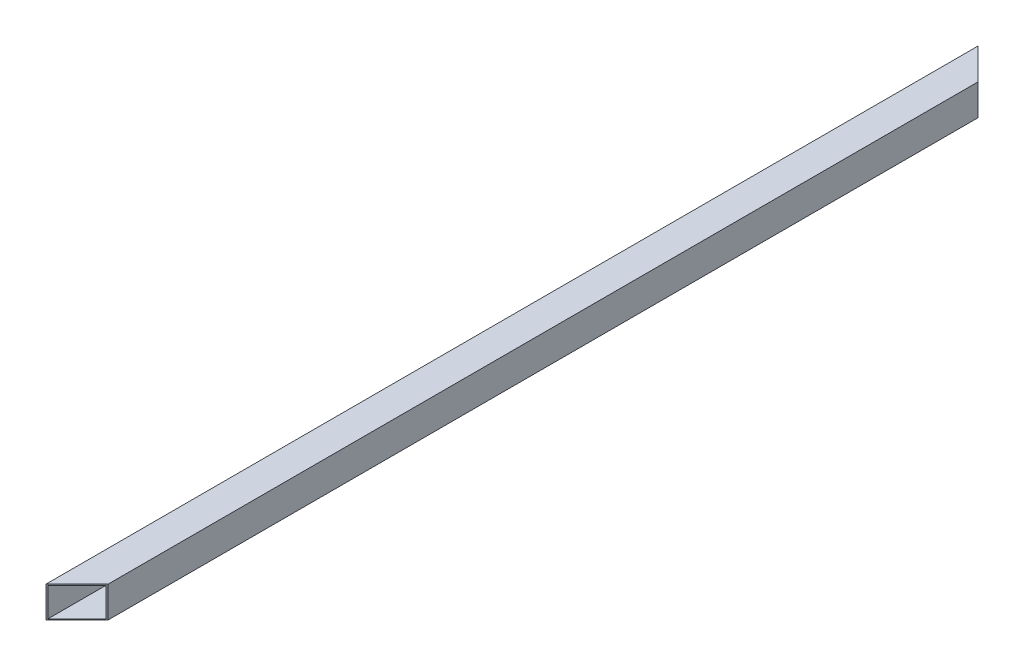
from build123d import *

# Parameters (mm, degrees)
SCHIZZO1_W                = 30
SCHIZZO1_H                = 30
SCHIZZO1_W_2              = 28
SCHIZZO1_H_2              = 28
ESTRUSIONE_SOTTILE1_DEPTH = 900
TAGLIO_ESTRUSIONE1_REACH  = 902.625


with BuildPart() as part:
    # Schizzo1 → Estrusione-Sottile1 (new body)
    with BuildSketch(Plane.XY):
        Rectangle(SCHIZZO1_W, SCHIZZO1_H)
        Rectangle(SCHIZZO1_W_2, SCHIZZO1_H_2, mode=Mode.SUBTRACT)
    extrude(amount=ESTRUSIONE_SOTTILE1_DEPTH)

    # Schizzo3 → Taglio-Estrusione1 (cut, up to next)
    with BuildSketch(Plane(origin=(0, 15, 0), x_dir=(1, 0, 0), z_dir=(0, 1, 0)), mode=Mode.PRIVATE) as taglio_estrusione1_sk1:
        Polygon((-15, 0), (15, -30), (15, 0), align=None)
    taglio_estrusione1_tool1 = extrude(taglio_estrusione1_sk1.sketch, amount=-TAGLIO_ESTRUSIONE1_REACH, mode=Mode.PRIVATE) & part.part
    taglio_estrusione1 = taglio_estrusione1_tool1.solids().sort_by_distance((5, 15, 10))[0]
    add(taglio_estrusione1, mode=Mode.SUBTRACT)

    # Specchia1: Taglio-Estrusione1 across plane
    add(taglio_estrusione1.mirror(Plane(origin=(0, 0, 450), x_dir=(1, 0, 0), z_dir=(0, 0, -1))), mode=Mode.SUBTRACT)


solid = part.part
